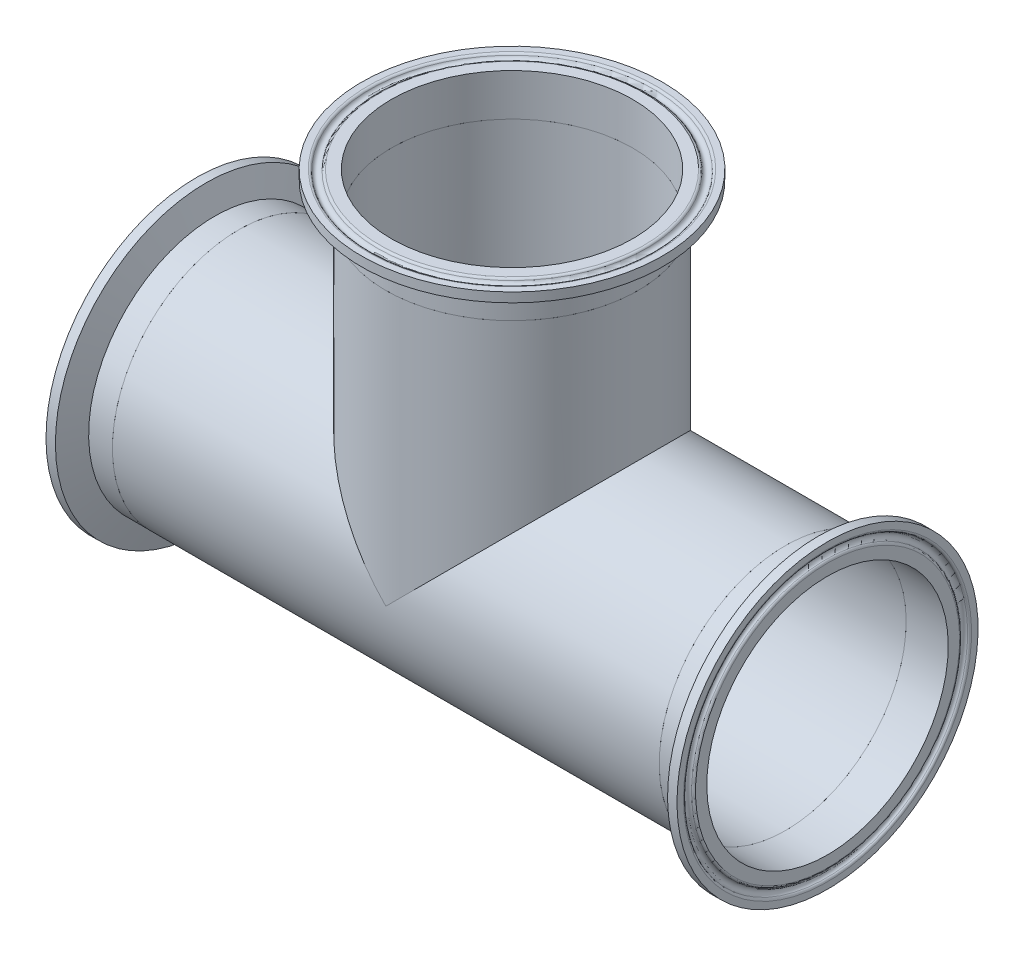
ISO-10303-21;
HEADER;
FILE_DESCRIPTION(('STEP AP214'),'2;1');
FILE_NAME('part.step','',(''),(''),'','','');
FILE_SCHEMA(('AUTOMOTIVE_DESIGN { 1 0 10303 214 1 1 1 1 }'));
ENDSEC;
DATA;
#1=APPLICATION_CONTEXT('core data for automotive mechanical design processes');
#2=APPLICATION_PROTOCOL_DEFINITION('international standard','automotive_design',2000,#1);
#3=PRODUCT_CONTEXT('',#1,'mechanical');
#4=PRODUCT('Part','Part','',(#3));
#5=PRODUCT_RELATED_PRODUCT_CATEGORY('part','',(#4));
#6=PRODUCT_DEFINITION_FORMATION('','',#4);
#7=PRODUCT_DEFINITION_CONTEXT('part definition',#1,'design');
#8=PRODUCT_DEFINITION('design','',#6,#7);
#9=PRODUCT_DEFINITION_SHAPE('','',#8);
#10=(LENGTH_UNIT() NAMED_UNIT(*) SI_UNIT(.MILLI.,.METRE.));
#11=(NAMED_UNIT(*) PLANE_ANGLE_UNIT() SI_UNIT($,.RADIAN.));
#12=(NAMED_UNIT(*) SI_UNIT($,.STERADIAN.) SOLID_ANGLE_UNIT());
#13=UNCERTAINTY_MEASURE_WITH_UNIT(LENGTH_MEASURE(1.E-05),#10,'distance_accuracy_value','');
#14=(GEOMETRIC_REPRESENTATION_CONTEXT(3) GLOBAL_UNCERTAINTY_ASSIGNED_CONTEXT((#13)) GLOBAL_UNIT_ASSIGNED_CONTEXT((#10,
#11,#12)) REPRESENTATION_CONTEXT('',''));
#15=CARTESIAN_POINT('',(0.,0.,0.));
#16=DIRECTION('',(0.,0.,1.));
#17=DIRECTION('',(1.,0.,0.));
#18=AXIS2_PLACEMENT_3D('',#15,#16,#17);
#19=CARTESIAN_POINT('',(170.205074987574,74.7151301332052,127.054306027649));
#20=DIRECTION('',(1.00000000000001,0.,0.));
#21=DIRECTION('',(0.,-0.815972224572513,0.578091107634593));
#22=AXIS2_PLACEMENT_3D('',#19,#20,#21);
#23=TOROIDAL_SURFACE('',#22,43.4867084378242,0.787400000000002);
#24=CARTESIAN_POINT('',(170.992474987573,74.7151301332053,127.054306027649));
#25=DIRECTION('',(1.00000000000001,0.,0.));
#26=DIRECTION('',(0.,-0.815972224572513,0.578091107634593));
#27=AXIS2_PLACEMENT_3D('',#24,#25,#26);
#28=CIRCLE('',#27,43.4867084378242);
#29=CARTESIAN_POINT('',(170.992474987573,39.2311839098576,152.193585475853));
#30=VERTEX_POINT('',#29);
#31=EDGE_CURVE('P0_E48',#30,#30,#28,.T.);
#32=ORIENTED_EDGE('',*,*,#31,.T.);
#33=EDGE_LOOP('',(#32));
#34=FACE_BOUND('',#33,.T.);
#35=CARTESIAN_POINT('',(170.518016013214,74.715130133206,127.054306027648));
#36=DIRECTION('',(1.00000000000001,0.,0.));
#37=DIRECTION('',(0.,-0.815972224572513,0.578091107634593));
#38=AXIS2_PLACEMENT_3D('',#35,#36,#37);
#39=CIRCLE('',#38,42.7641666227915);
#40=CARTESIAN_POINT('',(170.518016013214,39.8207579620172,151.775890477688));
#41=VERTEX_POINT('',#40);
#42=EDGE_CURVE('P0_E9',#41,#41,#39,.T.);
#43=ORIENTED_EDGE('',*,*,#42,.F.);
#44=EDGE_LOOP('',(#43));
#45=FACE_BOUND('',#44,.T.);
#46=ADVANCED_FACE('P0_F14',(#34,#45),#23,.T.);
#47=CARTESIAN_POINT('',(170.992474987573,74.7151301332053,127.054306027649));
#48=DIRECTION('',(1.00000000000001,0.,0.));
#49=DIRECTION('',(0.,-0.815972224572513,0.578091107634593));
#50=AXIS2_PLACEMENT_3D('',#47,#48,#49);
#51=TOROIDAL_SURFACE('',#50,41.6687,1.1938);
#52=CARTESIAN_POINT('',(170.518016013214,74.715130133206,127.054306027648));
#53=DIRECTION('',(1.00000000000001,0.,0.));
#54=DIRECTION('',(0.,-0.815972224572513,0.578091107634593));
#55=AXIS2_PLACEMENT_3D('',#52,#53,#54);
#56=CIRCLE('',#55,40.5732333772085);
#57=CARTESIAN_POINT('',(170.518016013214,41.6084986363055,150.509331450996));
#58=VERTEX_POINT('',#57);
#59=EDGE_CURVE('P0_E20',#58,#58,#56,.T.);
#60=ORIENTED_EDGE('',*,*,#59,.F.);
#61=EDGE_LOOP('',(#60));
#62=FACE_BOUND('',#61,.T.);
#63=ORIENTED_EDGE('',*,*,#42,.T.);
#64=EDGE_LOOP('',(#63));
#65=FACE_BOUND('',#64,.T.);
#66=ADVANCED_FACE('P0_F97',(#62,#65),#51,.F.);
#67=CARTESIAN_POINT('',(170.205074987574,74.7151301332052,127.054306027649));
#68=DIRECTION('',(1.00000000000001,0.,0.));
#69=DIRECTION('',(0.,-0.815972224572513,0.578091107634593));
#70=AXIS2_PLACEMENT_3D('',#67,#68,#69);
#71=TOROIDAL_SURFACE('',#70,39.8506915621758,0.787399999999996);
#72=ORIENTED_EDGE('',*,*,#59,.T.);
#73=EDGE_LOOP('',(#72));
#74=FACE_BOUND('',#73,.T.);
#75=CARTESIAN_POINT('',(170.992474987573,74.7151301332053,127.054306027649));
#76=DIRECTION('',(1.00000000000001,0.,0.));
#77=DIRECTION('',(0.,-0.815972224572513,0.578091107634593));
#78=AXIS2_PLACEMENT_3D('',#75,#76,#77);
#79=CIRCLE('',#78,39.8506915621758);
#80=CARTESIAN_POINT('',(170.992474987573,42.1980726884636,150.091636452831));
#81=VERTEX_POINT('',#80);
#82=EDGE_CURVE('P0_E24',#81,#81,#79,.T.);
#83=ORIENTED_EDGE('',*,*,#82,.F.);
#84=EDGE_LOOP('',(#83));
#85=FACE_BOUND('',#84,.T.);
#86=ADVANCED_FACE('P0_F93',(#74,#85),#71,.T.);
#87=CARTESIAN_POINT('',(170.992474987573,74.7151301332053,127.054306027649));
#88=DIRECTION('',(-1.00000000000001,0.,0.));
#89=DIRECTION('',(0.,0.815972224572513,-0.578091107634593));
#90=AXIS2_PLACEMENT_3D('',#87,#88,#89);
#91=PLANE('',#90);
#92=CARTESIAN_POINT('',(170.992474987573,74.7151301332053,127.054306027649));
#93=DIRECTION('',(1.00000000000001,0.,0.));
#94=DIRECTION('',(0.,-0.815972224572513,0.578091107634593));
#95=AXIS2_PLACEMENT_3D('',#92,#93,#94);
#96=CIRCLE('',#95,36.449);
#97=CARTESIAN_POINT('',(170.992474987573,44.9737585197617,148.125148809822));
#98=VERTEX_POINT('',#97);
#99=EDGE_CURVE('P0_E28',#98,#98,#96,.T.);
#100=ORIENTED_EDGE('',*,*,#99,.F.);
#101=EDGE_LOOP('',(#100));
#102=FACE_BOUND('',#101,.T.);
#103=ORIENTED_EDGE('',*,*,#82,.T.);
#104=EDGE_LOOP('',(#103));
#105=FACE_BOUND('',#104,.T.);
#106=ADVANCED_FACE('P0_F86',(#102,#105),#91,.F.);
#107=CARTESIAN_POINT('',(170.992474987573,74.7151301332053,127.054306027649));
#108=DIRECTION('',(1.00000000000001,0.,0.));
#109=DIRECTION('',(0.,-0.815972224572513,0.578091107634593));
#110=AXIS2_PLACEMENT_3D('',#107,#108,#109);
#111=CYLINDRICAL_SURFACE('',#110,36.449);
#112=ORIENTED_EDGE('',*,*,#99,.T.);
#113=EDGE_LOOP('',(#112));
#114=FACE_BOUND('',#113,.T.);
#115=CARTESIAN_POINT('',(158.292474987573,74.7151301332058,127.05430602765));
#116=DIRECTION('',(1.00000000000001,0.,0.));
#117=DIRECTION('',(0.,-0.815972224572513,0.578091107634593));
#118=AXIS2_PLACEMENT_3D('',#115,#116,#117);
#119=CIRCLE('',#118,36.449);
#120=CARTESIAN_POINT('',(158.292474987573,44.9737585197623,148.125148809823));
#121=VERTEX_POINT('',#120);
#122=EDGE_CURVE('P0_E33',#121,#121,#119,.T.);
#123=ORIENTED_EDGE('',*,*,#122,.F.);
#124=EDGE_LOOP('',(#123));
#125=FACE_BOUND('',#124,.T.);
#126=ADVANCED_FACE('P0_F81',(#114,#125),#111,.F.);
#127=CARTESIAN_POINT('',(158.292474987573,74.7151301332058,127.05430602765));
#128=DIRECTION('',(1.00000000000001,0.,0.));
#129=DIRECTION('',(0.,-0.815972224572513,0.578091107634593));
#130=AXIS2_PLACEMENT_3D('',#127,#128,#129);
#131=PLANE('',#130);
#132=CARTESIAN_POINT('',(158.292474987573,74.7151301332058,127.05430602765));
#133=DIRECTION('',(1.00000000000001,0.,0.));
#134=DIRECTION('',(0.,-0.815972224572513,0.578091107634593));
#135=AXIS2_PLACEMENT_3D('',#132,#133,#134);
#136=CIRCLE('',#135,38.1);
#137=CARTESIAN_POINT('',(158.292474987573,43.626588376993,149.079577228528));
#138=VERTEX_POINT('',#137);
#139=EDGE_CURVE('P0_E36',#138,#138,#136,.T.);
#140=ORIENTED_EDGE('',*,*,#139,.F.);
#141=EDGE_LOOP('',(#140));
#142=FACE_BOUND('',#141,.T.);
#143=ORIENTED_EDGE('',*,*,#122,.T.);
#144=EDGE_LOOP('',(#143));
#145=FACE_BOUND('',#144,.T.);
#146=ADVANCED_FACE('P0_F75',(#142,#145),#131,.F.);
#147=CARTESIAN_POINT('',(170.992474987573,74.7151301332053,127.054306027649));
#148=DIRECTION('',(1.00000000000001,0.,0.));
#149=DIRECTION('',(0.,-0.815972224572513,0.578091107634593));
#150=AXIS2_PLACEMENT_3D('',#147,#148,#149);
#151=CYLINDRICAL_SURFACE('',#150,38.1);
#152=CARTESIAN_POINT('',(165.471292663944,74.7151301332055,127.054306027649));
#153=DIRECTION('',(1.00000000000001,0.,0.));
#154=DIRECTION('',(0.,-0.815972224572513,0.578091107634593));
#155=AXIS2_PLACEMENT_3D('',#152,#153,#154);
#156=CIRCLE('',#155,38.1);
#157=CARTESIAN_POINT('',(165.471292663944,43.6265883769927,149.079577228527));
#158=VERTEX_POINT('',#157);
#159=EDGE_CURVE('P0_E39',#158,#158,#156,.T.);
#160=ORIENTED_EDGE('',*,*,#159,.F.);
#161=EDGE_LOOP('',(#160));
#162=FACE_BOUND('',#161,.T.);
#163=ORIENTED_EDGE('',*,*,#139,.T.);
#164=EDGE_LOOP('',(#163));
#165=FACE_BOUND('',#164,.T.);
#166=ADVANCED_FACE('P0_F69',(#162,#165),#151,.T.);
#167=CARTESIAN_POINT('',(165.471292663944,74.7151301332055,127.054306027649));
#168=DIRECTION('',(1.00000000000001,0.,0.));
#169=DIRECTION('',(0.,-0.815972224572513,0.578091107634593));
#170=AXIS2_PLACEMENT_3D('',#167,#168,#169);
#171=CONICAL_SURFACE('',#170,38.1,1.22173047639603);
#172=CARTESIAN_POINT('',(168.147674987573,74.7151301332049,127.054306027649));
#173=DIRECTION('',(1.00000000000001,0.,0.));
#174=DIRECTION('',(0.,-0.815972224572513,0.578091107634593));
#175=AXIS2_PLACEMENT_3D('',#172,#173,#174);
#176=CIRCLE('',#175,45.4533);
#177=CARTESIAN_POINT('',(168.147674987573,37.6264998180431,153.330454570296));
#178=VERTEX_POINT('',#177);
#179=EDGE_CURVE('P0_E42',#178,#178,#176,.T.);
#180=ORIENTED_EDGE('',*,*,#179,.F.);
#181=EDGE_LOOP('',(#180));
#182=FACE_BOUND('',#181,.T.);
#183=ORIENTED_EDGE('',*,*,#159,.T.);
#184=EDGE_LOOP('',(#183));
#185=FACE_BOUND('',#184,.T.);
#186=ADVANCED_FACE('P0_F63',(#182,#185),#171,.T.);
#187=CARTESIAN_POINT('',(170.992474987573,74.7151301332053,127.054306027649));
#188=DIRECTION('',(1.00000000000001,0.,0.));
#189=DIRECTION('',(0.,-0.815972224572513,0.578091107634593));
#190=AXIS2_PLACEMENT_3D('',#187,#188,#189);
#191=CYLINDRICAL_SURFACE('',#190,45.4533);
#192=CARTESIAN_POINT('',(170.992474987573,74.7151301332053,127.054306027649));
#193=DIRECTION('',(1.00000000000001,0.,0.));
#194=DIRECTION('',(0.,-0.815972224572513,0.578091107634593));
#195=AXIS2_PLACEMENT_3D('',#192,#193,#194);
#196=CIRCLE('',#195,45.4533);
#197=CARTESIAN_POINT('',(170.992474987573,37.6264998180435,153.330454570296));
#198=VERTEX_POINT('',#197);
#199=EDGE_CURVE('P0_E45',#198,#198,#196,.T.);
#200=ORIENTED_EDGE('',*,*,#199,.F.);
#201=EDGE_LOOP('',(#200));
#202=FACE_BOUND('',#201,.T.);
#203=ORIENTED_EDGE('',*,*,#179,.T.);
#204=EDGE_LOOP('',(#203));
#205=FACE_BOUND('',#204,.T.);
#206=ADVANCED_FACE('P0_F57',(#202,#205),#191,.T.);
#207=CARTESIAN_POINT('',(170.992474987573,74.7151301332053,127.054306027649));
#208=DIRECTION('',(-1.00000000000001,0.,0.));
#209=DIRECTION('',(0.,0.815972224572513,-0.578091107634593));
#210=AXIS2_PLACEMENT_3D('',#207,#208,#209);
#211=PLANE('',#210);
#212=ORIENTED_EDGE('',*,*,#31,.F.);
#213=EDGE_LOOP('',(#212));
#214=FACE_BOUND('',#213,.T.);
#215=ORIENTED_EDGE('',*,*,#199,.T.);
#216=EDGE_LOOP('',(#215));
#217=FACE_BOUND('',#216,.T.);
#218=ADVANCED_FACE('P0_F54',(#214,#217),#211,.F.);
#219=CLOSED_SHELL('',(#46,#66,#86,#106,#126,#146,#166,#186,#206,#218));
#220=MANIFOLD_SOLID_BREP('P0_B1',#219);
#221=CARTESIAN_POINT('',(75.7424749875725,169.177730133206,127.05430602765));
#222=DIRECTION('',(0.,1.00000000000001,0.));
#223=DIRECTION('',(-0.679087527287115,0.,-0.734057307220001));
#224=AXIS2_PLACEMENT_3D('',#221,#222,#223);
#225=TOROIDAL_SURFACE('',#224,43.4867084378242,0.787400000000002);
#226=CARTESIAN_POINT('',(75.7424749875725,169.965130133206,127.05430602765));
#227=DIRECTION('',(0.,1.00000000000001,0.));
#228=DIRECTION('',(-0.679087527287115,0.,-0.734057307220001));
#229=AXIS2_PLACEMENT_3D('',#226,#227,#228);
#230=CIRCLE('',#229,43.4867084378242);
#231=CARTESIAN_POINT('',(46.2111936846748,169.965130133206,95.1325699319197));
#232=VERTEX_POINT('',#231);
#233=EDGE_CURVE('P1_E49',#232,#232,#230,.T.);
#234=ORIENTED_EDGE('',*,*,#233,.T.);
#235=EDGE_LOOP('',(#234));
#236=FACE_BOUND('',#235,.T.);
#237=CARTESIAN_POINT('',(75.7424749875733,169.490671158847,127.054306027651));
#238=DIRECTION('',(0.,1.00000000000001,0.));
#239=DIRECTION('',(-0.679087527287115,0.,-0.734057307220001));
#240=AXIS2_PLACEMENT_3D('',#237,#238,#239);
#241=CIRCLE('',#240,42.7641666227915);
#242=CARTESIAN_POINT('',(46.7018628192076,169.490671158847,95.6629570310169));
#243=VERTEX_POINT('',#242);
#244=EDGE_CURVE('P1_E10',#243,#243,#241,.T.);
#245=ORIENTED_EDGE('',*,*,#244,.F.);
#246=EDGE_LOOP('',(#245));
#247=FACE_BOUND('',#246,.T.);
#248=ADVANCED_FACE('P1_F15',(#236,#247),#225,.T.);
#249=CARTESIAN_POINT('',(75.7424749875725,169.965130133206,127.05430602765));
#250=DIRECTION('',(0.,1.00000000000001,0.));
#251=DIRECTION('',(-0.679087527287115,0.,-0.734057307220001));
#252=AXIS2_PLACEMENT_3D('',#249,#250,#251);
#253=TOROIDAL_SURFACE('',#252,41.6687,1.1938);
#254=CARTESIAN_POINT('',(75.7424749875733,169.490671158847,127.054306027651));
#255=DIRECTION('',(0.,1.00000000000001,0.));
#256=DIRECTION('',(-0.679087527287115,0.,-0.734057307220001));
#257=AXIS2_PLACEMENT_3D('',#254,#255,#256);
#258=CIRCLE('',#257,40.5732333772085);
#259=CARTESIAN_POINT('',(48.1896982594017,169.490671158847,97.2712275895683));
#260=VERTEX_POINT('',#259);
#261=EDGE_CURVE('P1_E21',#260,#260,#258,.T.);
#262=ORIENTED_EDGE('',*,*,#261,.F.);
#263=EDGE_LOOP('',(#262));
#264=FACE_BOUND('',#263,.T.);
#265=ORIENTED_EDGE('',*,*,#244,.T.);
#266=EDGE_LOOP('',(#265));
#267=FACE_BOUND('',#266,.T.);
#268=ADVANCED_FACE('P1_F98',(#264,#267),#253,.F.);
#269=CARTESIAN_POINT('',(75.7424749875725,169.177730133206,127.05430602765));
#270=DIRECTION('',(0.,1.00000000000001,0.));
#271=DIRECTION('',(-0.679087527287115,0.,-0.734057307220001));
#272=AXIS2_PLACEMENT_3D('',#269,#270,#271);
#273=TOROIDAL_SURFACE('',#272,39.8506915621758,0.787399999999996);
#274=ORIENTED_EDGE('',*,*,#261,.T.);
#275=EDGE_LOOP('',(#274));
#276=FACE_BOUND('',#275,.T.);
#277=CARTESIAN_POINT('',(75.7424749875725,169.965130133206,127.05430602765));
#278=DIRECTION('',(0.,1.00000000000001,0.));
#279=DIRECTION('',(-0.679087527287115,0.,-0.734057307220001));
#280=AXIS2_PLACEMENT_3D('',#277,#278,#279);
#281=CIRCLE('',#280,39.8506915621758);
#282=CARTESIAN_POINT('',(48.6803673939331,169.965130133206,97.8016146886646));
#283=VERTEX_POINT('',#282);
#284=EDGE_CURVE('P1_E25',#283,#283,#281,.T.);
#285=ORIENTED_EDGE('',*,*,#284,.F.);
#286=EDGE_LOOP('',(#285));
#287=FACE_BOUND('',#286,.T.);
#288=ADVANCED_FACE('P1_F94',(#276,#287),#273,.T.);
#289=CARTESIAN_POINT('',(75.7424749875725,169.965130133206,127.05430602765));
#290=DIRECTION('',(0.,-1.00000000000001,0.));
#291=DIRECTION('',(0.679087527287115,0.,0.734057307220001));
#292=AXIS2_PLACEMENT_3D('',#289,#290,#291);
#293=PLANE('',#292);
#294=CARTESIAN_POINT('',(75.7424749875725,169.965130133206,127.05430602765));
#295=DIRECTION('',(0.,1.00000000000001,0.));
#296=DIRECTION('',(-0.679087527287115,0.,-0.734057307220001));
#297=AXIS2_PLACEMENT_3D('',#294,#295,#296);
#298=CIRCLE('',#297,36.449);
#299=CARTESIAN_POINT('',(50.9904137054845,169.965130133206,100.298651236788));
#300=VERTEX_POINT('',#299);
#301=EDGE_CURVE('P1_E29',#300,#300,#298,.T.);
#302=ORIENTED_EDGE('',*,*,#301,.F.);
#303=EDGE_LOOP('',(#302));
#304=FACE_BOUND('',#303,.T.);
#305=ORIENTED_EDGE('',*,*,#284,.T.);
#306=EDGE_LOOP('',(#305));
#307=FACE_BOUND('',#306,.T.);
#308=ADVANCED_FACE('P1_F87',(#304,#307),#293,.F.);
#309=CARTESIAN_POINT('',(75.7424749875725,169.965130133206,127.05430602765));
#310=DIRECTION('',(0.,1.00000000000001,0.));
#311=DIRECTION('',(-0.679087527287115,0.,-0.734057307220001));
#312=AXIS2_PLACEMENT_3D('',#309,#310,#311);
#313=CYLINDRICAL_SURFACE('',#312,36.449);
#314=ORIENTED_EDGE('',*,*,#301,.T.);
#315=EDGE_LOOP('',(#314));
#316=FACE_BOUND('',#315,.T.);
#317=CARTESIAN_POINT('',(75.7424749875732,157.265130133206,127.05430602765));
#318=DIRECTION('',(0.,1.00000000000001,0.));
#319=DIRECTION('',(-0.679087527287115,0.,-0.734057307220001));
#320=AXIS2_PLACEMENT_3D('',#317,#318,#319);
#321=CIRCLE('',#320,36.449);
#322=CARTESIAN_POINT('',(50.9904137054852,157.265130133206,100.298651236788));
#323=VERTEX_POINT('',#322);
#324=EDGE_CURVE('P1_E34',#323,#323,#321,.T.);
#325=ORIENTED_EDGE('',*,*,#324,.F.);
#326=EDGE_LOOP('',(#325));
#327=FACE_BOUND('',#326,.T.);
#328=ADVANCED_FACE('P1_F82',(#316,#327),#313,.F.);
#329=CARTESIAN_POINT('',(75.7424749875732,157.265130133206,127.05430602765));
#330=DIRECTION('',(0.,1.00000000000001,0.));
#331=DIRECTION('',(-0.679087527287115,0.,-0.734057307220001));
#332=AXIS2_PLACEMENT_3D('',#329,#330,#331);
#333=PLANE('',#332);
#334=CARTESIAN_POINT('',(75.7424749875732,157.265130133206,127.05430602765));
#335=DIRECTION('',(0.,1.00000000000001,0.));
#336=DIRECTION('',(-0.679087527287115,0.,-0.734057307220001));
#337=AXIS2_PLACEMENT_3D('',#334,#335,#336);
#338=CIRCLE('',#337,38.1);
#339=CARTESIAN_POINT('',(49.8692401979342,157.265130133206,99.0867226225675));
#340=VERTEX_POINT('',#339);
#341=EDGE_CURVE('P1_E37',#340,#340,#338,.T.);
#342=ORIENTED_EDGE('',*,*,#341,.F.);
#343=EDGE_LOOP('',(#342));
#344=FACE_BOUND('',#343,.T.);
#345=ORIENTED_EDGE('',*,*,#324,.T.);
#346=EDGE_LOOP('',(#345));
#347=FACE_BOUND('',#346,.T.);
#348=ADVANCED_FACE('P1_F76',(#344,#347),#333,.F.);
#349=CARTESIAN_POINT('',(75.7424749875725,169.965130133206,127.05430602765));
#350=DIRECTION('',(0.,1.00000000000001,0.));
#351=DIRECTION('',(-0.679087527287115,0.,-0.734057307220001));
#352=AXIS2_PLACEMENT_3D('',#349,#350,#351);
#353=CYLINDRICAL_SURFACE('',#352,38.1);
#354=CARTESIAN_POINT('',(75.7424749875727,164.443947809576,127.05430602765));
#355=DIRECTION('',(0.,1.00000000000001,0.));
#356=DIRECTION('',(-0.679087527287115,0.,-0.734057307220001));
#357=AXIS2_PLACEMENT_3D('',#354,#355,#356);
#358=CIRCLE('',#357,38.1);
#359=CARTESIAN_POINT('',(49.8692401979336,164.443947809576,99.0867226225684));
#360=VERTEX_POINT('',#359);
#361=EDGE_CURVE('P1_E40',#360,#360,#358,.T.);
#362=ORIENTED_EDGE('',*,*,#361,.F.);
#363=EDGE_LOOP('',(#362));
#364=FACE_BOUND('',#363,.T.);
#365=ORIENTED_EDGE('',*,*,#341,.T.);
#366=EDGE_LOOP('',(#365));
#367=FACE_BOUND('',#366,.T.);
#368=ADVANCED_FACE('P1_F70',(#364,#367),#353,.T.);
#369=CARTESIAN_POINT('',(75.7424749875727,164.443947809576,127.05430602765));
#370=DIRECTION('',(0.,1.00000000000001,0.));
#371=DIRECTION('',(-0.679087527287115,0.,-0.734057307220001));
#372=AXIS2_PLACEMENT_3D('',#369,#370,#371);
#373=CONICAL_SURFACE('',#372,38.1,1.22173047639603);
#374=CARTESIAN_POINT('',(75.7424749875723,167.120330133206,127.05430602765));
#375=DIRECTION('',(0.,1.00000000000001,0.));
#376=DIRECTION('',(-0.679087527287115,0.,-0.734057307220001));
#377=AXIS2_PLACEMENT_3D('',#374,#375,#376);
#378=CIRCLE('',#377,45.4533);
#379=CARTESIAN_POINT('',(44.8757058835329,167.120330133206,93.6889790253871));
#380=VERTEX_POINT('',#379);
#381=EDGE_CURVE('P1_E43',#380,#380,#378,.T.);
#382=ORIENTED_EDGE('',*,*,#381,.F.);
#383=EDGE_LOOP('',(#382));
#384=FACE_BOUND('',#383,.T.);
#385=ORIENTED_EDGE('',*,*,#361,.T.);
#386=EDGE_LOOP('',(#385));
#387=FACE_BOUND('',#386,.T.);
#388=ADVANCED_FACE('P1_F64',(#384,#387),#373,.T.);
#389=CARTESIAN_POINT('',(75.7424749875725,169.965130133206,127.05430602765));
#390=DIRECTION('',(0.,1.00000000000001,0.));
#391=DIRECTION('',(-0.679087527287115,0.,-0.734057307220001));
#392=AXIS2_PLACEMENT_3D('',#389,#390,#391);
#393=CYLINDRICAL_SURFACE('',#392,45.4533);
#394=CARTESIAN_POINT('',(75.7424749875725,169.965130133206,127.05430602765));
#395=DIRECTION('',(0.,1.00000000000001,0.));
#396=DIRECTION('',(-0.679087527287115,0.,-0.734057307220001));
#397=AXIS2_PLACEMENT_3D('',#394,#395,#396);
#398=CIRCLE('',#397,45.4533);
#399=CARTESIAN_POINT('',(44.8757058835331,169.965130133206,93.6889790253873));
#400=VERTEX_POINT('',#399);
#401=EDGE_CURVE('P1_E46',#400,#400,#398,.T.);
#402=ORIENTED_EDGE('',*,*,#401,.F.);
#403=EDGE_LOOP('',(#402));
#404=FACE_BOUND('',#403,.T.);
#405=ORIENTED_EDGE('',*,*,#381,.T.);
#406=EDGE_LOOP('',(#405));
#407=FACE_BOUND('',#406,.T.);
#408=ADVANCED_FACE('P1_F58',(#404,#407),#393,.T.);
#409=CARTESIAN_POINT('',(75.7424749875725,169.965130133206,127.05430602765));
#410=DIRECTION('',(0.,-1.00000000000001,0.));
#411=DIRECTION('',(0.679087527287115,0.,0.734057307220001));
#412=AXIS2_PLACEMENT_3D('',#409,#410,#411);
#413=PLANE('',#412);
#414=ORIENTED_EDGE('',*,*,#233,.F.);
#415=EDGE_LOOP('',(#414));
#416=FACE_BOUND('',#415,.T.);
#417=ORIENTED_EDGE('',*,*,#401,.T.);
#418=EDGE_LOOP('',(#417));
#419=FACE_BOUND('',#418,.T.);
#420=ADVANCED_FACE('P1_F55',(#416,#419),#413,.F.);
#421=CLOSED_SHELL('',(#248,#268,#288,#308,#328,#348,#368,#388,#408,#420));
#422=MANIFOLD_SOLID_BREP('P1_B1',#421);
#423=CARTESIAN_POINT('',(-18.7201250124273,74.715130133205,127.054306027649));
#424=DIRECTION('',(-1.00000000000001,0.,0.));
#425=DIRECTION('',(0.,0.785082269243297,-0.619391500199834));
#426=AXIS2_PLACEMENT_3D('',#423,#424,#425);
#427=TOROIDAL_SURFACE('',#426,43.4867084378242,0.787400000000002);
#428=CARTESIAN_POINT('',(-19.5075250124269,74.7151301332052,127.054306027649));
#429=DIRECTION('',(-1.00000000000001,0.,0.));
#430=DIRECTION('',(0.,0.785082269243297,-0.619391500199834));
#431=AXIS2_PLACEMENT_3D('',#428,#429,#430);
#432=CIRCLE('',#431,43.4867084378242);
#433=CARTESIAN_POINT('',(-19.5075250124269,108.855773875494,100.119008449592));
#434=VERTEX_POINT('',#433);
#435=EDGE_CURVE('P2_E49',#434,#434,#432,.T.);
#436=ORIENTED_EDGE('',*,*,#435,.T.);
#437=EDGE_LOOP('',(#436));
#438=FACE_BOUND('',#437,.T.);
#439=CARTESIAN_POINT('',(-19.0330660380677,74.7151301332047,127.054306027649));
#440=DIRECTION('',(-1.00000000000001,0.,0.));
#441=DIRECTION('',(0.,0.785082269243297,-0.619391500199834));
#442=AXIS2_PLACEMENT_3D('',#439,#440,#441);
#443=CIRCLE('',#442,42.7641666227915);
#444=CARTESIAN_POINT('',(-19.0330660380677,108.288519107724,100.566544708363));
#445=VERTEX_POINT('',#444);
#446=EDGE_CURVE('P2_E10',#445,#445,#443,.T.);
#447=ORIENTED_EDGE('',*,*,#446,.F.);
#448=EDGE_LOOP('',(#447));
#449=FACE_BOUND('',#448,.T.);
#450=ADVANCED_FACE('P2_F15',(#438,#449),#427,.T.);
#451=CARTESIAN_POINT('',(-19.5075250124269,74.7151301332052,127.054306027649));
#452=DIRECTION('',(-1.00000000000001,0.,0.));
#453=DIRECTION('',(0.,0.785082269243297,-0.619391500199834));
#454=AXIS2_PLACEMENT_3D('',#451,#452,#453);
#455=TOROIDAL_SURFACE('',#454,41.6687,1.1938);
#456=CARTESIAN_POINT('',(-19.0330660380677,74.7151301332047,127.054306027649));
#457=DIRECTION('',(-1.00000000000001,0.,0.));
#458=DIRECTION('',(0.,0.785082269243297,-0.619391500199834));
#459=AXIS2_PLACEMENT_3D('',#456,#457,#458);
#460=CIRCLE('',#459,40.5732333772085);
#461=CARTESIAN_POINT('',(-19.0330660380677,106.568456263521,101.923590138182));
#462=VERTEX_POINT('',#461);
#463=EDGE_CURVE('P2_E21',#462,#462,#460,.T.);
#464=ORIENTED_EDGE('',*,*,#463,.F.);
#465=EDGE_LOOP('',(#464));
#466=FACE_BOUND('',#465,.T.);
#467=ORIENTED_EDGE('',*,*,#446,.T.);
#468=EDGE_LOOP('',(#467));
#469=FACE_BOUND('',#468,.T.);
#470=ADVANCED_FACE('P2_F98',(#466,#469),#455,.F.);
#471=CARTESIAN_POINT('',(-18.7201250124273,74.715130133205,127.054306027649));
#472=DIRECTION('',(-1.00000000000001,0.,0.));
#473=DIRECTION('',(0.,0.785082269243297,-0.619391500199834));
#474=AXIS2_PLACEMENT_3D('',#471,#472,#473);
#475=TOROIDAL_SURFACE('',#474,39.8506915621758,0.787399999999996);
#476=ORIENTED_EDGE('',*,*,#463,.T.);
#477=EDGE_LOOP('',(#476));
#478=FACE_BOUND('',#477,.T.);
#479=CARTESIAN_POINT('',(-19.5075250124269,74.7151301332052,127.054306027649));
#480=DIRECTION('',(-1.00000000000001,0.,0.));
#481=DIRECTION('',(0.,0.785082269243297,-0.619391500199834));
#482=AXIS2_PLACEMENT_3D('',#479,#480,#481);
#483=CIRCLE('',#482,39.8506915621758);
#484=CARTESIAN_POINT('',(-19.5075250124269,106.001201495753,102.371126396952));
#485=VERTEX_POINT('',#484);
#486=EDGE_CURVE('P2_E25',#485,#485,#483,.T.);
#487=ORIENTED_EDGE('',*,*,#486,.F.);
#488=EDGE_LOOP('',(#487));
#489=FACE_BOUND('',#488,.T.);
#490=ADVANCED_FACE('P2_F94',(#478,#489),#475,.T.);
#491=CARTESIAN_POINT('',(-19.5075250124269,74.7151301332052,127.054306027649));
#492=DIRECTION('',(1.00000000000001,0.,0.));
#493=DIRECTION('',(0.,-0.785082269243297,0.619391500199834));
#494=AXIS2_PLACEMENT_3D('',#491,#492,#493);
#495=PLANE('',#494);
#496=CARTESIAN_POINT('',(-19.5075250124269,74.7151301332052,127.054306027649));
#497=DIRECTION('',(-1.00000000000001,0.,0.));
#498=DIRECTION('',(0.,0.785082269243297,-0.619391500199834));
#499=AXIS2_PLACEMENT_3D('',#496,#497,#498);
#500=CIRCLE('',#499,36.449);
#501=CARTESIAN_POINT('',(-19.5075250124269,103.330593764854,104.478105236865));
#502=VERTEX_POINT('',#501);
#503=EDGE_CURVE('P2_E29',#502,#502,#500,.T.);
#504=ORIENTED_EDGE('',*,*,#503,.F.);
#505=EDGE_LOOP('',(#504));
#506=FACE_BOUND('',#505,.T.);
#507=ORIENTED_EDGE('',*,*,#486,.T.);
#508=EDGE_LOOP('',(#507));
#509=FACE_BOUND('',#508,.T.);
#510=ADVANCED_FACE('P2_F87',(#506,#509),#495,.F.);
#511=CARTESIAN_POINT('',(-19.5075250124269,74.7151301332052,127.054306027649));
#512=DIRECTION('',(-1.00000000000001,0.,0.));
#513=DIRECTION('',(0.,0.785082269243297,-0.619391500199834));
#514=AXIS2_PLACEMENT_3D('',#511,#512,#513);
#515=CYLINDRICAL_SURFACE('',#514,36.449);
#516=ORIENTED_EDGE('',*,*,#503,.T.);
#517=EDGE_LOOP('',(#516));
#518=FACE_BOUND('',#517,.T.);
#519=CARTESIAN_POINT('',(-6.80752501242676,74.7151301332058,127.05430602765));
#520=DIRECTION('',(-1.00000000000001,0.,0.));
#521=DIRECTION('',(0.,0.785082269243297,-0.619391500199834));
#522=AXIS2_PLACEMENT_3D('',#519,#520,#521);
#523=CIRCLE('',#522,36.449);
#524=CARTESIAN_POINT('',(-6.80752501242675,103.330593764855,104.478105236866));
#525=VERTEX_POINT('',#524);
#526=EDGE_CURVE('P2_E34',#525,#525,#523,.T.);
#527=ORIENTED_EDGE('',*,*,#526,.F.);
#528=EDGE_LOOP('',(#527));
#529=FACE_BOUND('',#528,.T.);
#530=ADVANCED_FACE('P2_F82',(#518,#529),#515,.F.);
#531=CARTESIAN_POINT('',(-6.80752501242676,74.7151301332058,127.05430602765));
#532=DIRECTION('',(-1.00000000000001,0.,0.));
#533=DIRECTION('',(0.,0.785082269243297,-0.619391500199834));
#534=AXIS2_PLACEMENT_3D('',#531,#532,#533);
#535=PLANE('',#534);
#536=CARTESIAN_POINT('',(-6.80752501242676,74.7151301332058,127.05430602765));
#537=DIRECTION('',(-1.00000000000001,0.,0.));
#538=DIRECTION('',(0.,0.785082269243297,-0.619391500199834));
#539=AXIS2_PLACEMENT_3D('',#536,#537,#538);
#540=CIRCLE('',#539,38.1);
#541=CARTESIAN_POINT('',(-6.80752501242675,104.626764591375,103.455489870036));
#542=VERTEX_POINT('',#541);
#543=EDGE_CURVE('P2_E37',#542,#542,#540,.T.);
#544=ORIENTED_EDGE('',*,*,#543,.F.);
#545=EDGE_LOOP('',(#544));
#546=FACE_BOUND('',#545,.T.);
#547=ORIENTED_EDGE('',*,*,#526,.T.);
#548=EDGE_LOOP('',(#547));
#549=FACE_BOUND('',#548,.T.);
#550=ADVANCED_FACE('P2_F76',(#546,#549),#535,.F.);
#551=CARTESIAN_POINT('',(-19.5075250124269,74.7151301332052,127.054306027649));
#552=DIRECTION('',(-1.00000000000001,0.,0.));
#553=DIRECTION('',(0.,0.785082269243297,-0.619391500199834));
#554=AXIS2_PLACEMENT_3D('',#551,#552,#553);
#555=CYLINDRICAL_SURFACE('',#554,38.1);
#556=CARTESIAN_POINT('',(-13.9863426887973,74.7151301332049,127.054306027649));
#557=DIRECTION('',(-1.00000000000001,0.,0.));
#558=DIRECTION('',(0.,0.785082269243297,-0.619391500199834));
#559=AXIS2_PLACEMENT_3D('',#556,#557,#558);
#560=CIRCLE('',#559,38.1);
#561=CARTESIAN_POINT('',(-13.9863426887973,104.626764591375,103.455489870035));
#562=VERTEX_POINT('',#561);
#563=EDGE_CURVE('P2_E40',#562,#562,#560,.T.);
#564=ORIENTED_EDGE('',*,*,#563,.F.);
#565=EDGE_LOOP('',(#564));
#566=FACE_BOUND('',#565,.T.);
#567=ORIENTED_EDGE('',*,*,#543,.T.);
#568=EDGE_LOOP('',(#567));
#569=FACE_BOUND('',#568,.T.);
#570=ADVANCED_FACE('P2_F70',(#566,#569),#555,.T.);
#571=CARTESIAN_POINT('',(-13.9863426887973,74.7151301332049,127.054306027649));
#572=DIRECTION('',(-1.00000000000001,0.,0.));
#573=DIRECTION('',(0.,0.785082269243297,-0.619391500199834));
#574=AXIS2_PLACEMENT_3D('',#571,#572,#573);
#575=CONICAL_SURFACE('',#574,38.1,1.22173047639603);
#576=CARTESIAN_POINT('',(-16.6627250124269,74.7151301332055,127.054306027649));
#577=DIRECTION('',(-1.00000000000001,0.,0.));
#578=DIRECTION('',(0.,0.785082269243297,-0.619391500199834));
#579=AXIS2_PLACEMENT_3D('',#576,#577,#578);
#580=CIRCLE('',#579,45.4533);
#581=CARTESIAN_POINT('',(-16.6627250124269,110.399710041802,98.9009183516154));
#582=VERTEX_POINT('',#581);
#583=EDGE_CURVE('P2_E43',#582,#582,#580,.T.);
#584=ORIENTED_EDGE('',*,*,#583,.F.);
#585=EDGE_LOOP('',(#584));
#586=FACE_BOUND('',#585,.T.);
#587=ORIENTED_EDGE('',*,*,#563,.T.);
#588=EDGE_LOOP('',(#587));
#589=FACE_BOUND('',#588,.T.);
#590=ADVANCED_FACE('P2_F64',(#586,#589),#575,.T.);
#591=CARTESIAN_POINT('',(-19.5075250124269,74.7151301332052,127.054306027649));
#592=DIRECTION('',(-1.00000000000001,0.,0.));
#593=DIRECTION('',(0.,0.785082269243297,-0.619391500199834));
#594=AXIS2_PLACEMENT_3D('',#591,#592,#593);
#595=CYLINDRICAL_SURFACE('',#594,45.4533);
#596=CARTESIAN_POINT('',(-19.5075250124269,74.7151301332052,127.054306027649));
#597=DIRECTION('',(-1.00000000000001,0.,0.));
#598=DIRECTION('',(0.,0.785082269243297,-0.619391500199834));
#599=AXIS2_PLACEMENT_3D('',#596,#597,#598);
#600=CIRCLE('',#599,45.4533);
#601=CARTESIAN_POINT('',(-19.5075250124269,110.399710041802,98.9009183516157));
#602=VERTEX_POINT('',#601);
#603=EDGE_CURVE('P2_E46',#602,#602,#600,.T.);
#604=ORIENTED_EDGE('',*,*,#603,.F.);
#605=EDGE_LOOP('',(#604));
#606=FACE_BOUND('',#605,.T.);
#607=ORIENTED_EDGE('',*,*,#583,.T.);
#608=EDGE_LOOP('',(#607));
#609=FACE_BOUND('',#608,.T.);
#610=ADVANCED_FACE('P2_F58',(#606,#609),#595,.T.);
#611=CARTESIAN_POINT('',(-19.5075250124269,74.7151301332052,127.054306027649));
#612=DIRECTION('',(1.00000000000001,0.,0.));
#613=DIRECTION('',(0.,-0.785082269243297,0.619391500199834));
#614=AXIS2_PLACEMENT_3D('',#611,#612,#613);
#615=PLANE('',#614);
#616=ORIENTED_EDGE('',*,*,#435,.F.);
#617=EDGE_LOOP('',(#616));
#618=FACE_BOUND('',#617,.T.);
#619=ORIENTED_EDGE('',*,*,#603,.T.);
#620=EDGE_LOOP('',(#619));
#621=FACE_BOUND('',#620,.T.);
#622=ADVANCED_FACE('P2_F55',(#618,#621),#615,.F.);
#623=CLOSED_SHELL('',(#450,#470,#490,#510,#530,#550,#570,#590,#610,#622));
#624=MANIFOLD_SOLID_BREP('P2_B1',#623);
#625=CARTESIAN_POINT('',(75.7424749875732,157.265130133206,127.05430602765));
#626=DIRECTION('',(0.,-1.,0.));
#627=DIRECTION('',(0.,0.,-1.));
#628=AXIS2_PLACEMENT_3D('',#625,#626,#627);
#629=CYLINDRICAL_SURFACE('',#628,38.1);
#630=CARTESIAN_POINT('',(75.7424749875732,157.265130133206,127.05430602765));
#631=DIRECTION('',(0.,1.,0.));
#632=DIRECTION('',(0.,0.,1.));
#633=AXIS2_PLACEMENT_3D('',#630,#631,#632);
#634=CIRCLE('',#633,38.1);
#635=CARTESIAN_POINT('',(75.7424749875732,157.265130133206,165.15430602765));
#636=VERTEX_POINT('',#635);
#637=EDGE_CURVE('P3_E11',#636,#636,#634,.T.);
#638=ORIENTED_EDGE('',*,*,#637,.F.);
#639=EDGE_LOOP('',(#638));
#640=FACE_BOUND('',#639,.T.);
#641=CARTESIAN_POINT('',(75.7424749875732,74.7151301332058,127.05430602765));
#642=DIRECTION('',(-0.707106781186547,-0.707106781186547,0.));
#643=DIRECTION('',(0.707106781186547,-0.707106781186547,0.));
#644=AXIS2_PLACEMENT_3D('',#641,#642,#643);
#645=ELLIPSE('',#644,53.8815367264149,38.1);
#646=CARTESIAN_POINT('',(75.7424749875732,74.7151301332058,165.15430602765));
#647=VERTEX_POINT('',#646);
#648=CARTESIAN_POINT('',(75.7424749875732,74.7151301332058,88.9543060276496));
#649=VERTEX_POINT('',#648);
#650=EDGE_CURVE('P3_E24',#647,#649,#645,.T.);
#651=ORIENTED_EDGE('',*,*,#650,.F.);
#652=CARTESIAN_POINT('',(75.7424749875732,74.7151301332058,127.05430602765));
#653=DIRECTION('',(0.707106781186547,-0.707106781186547,0.));
#654=DIRECTION('',(-0.707106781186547,-0.707106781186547,0.));
#655=AXIS2_PLACEMENT_3D('',#652,#653,#654);
#656=ELLIPSE('',#655,53.8815367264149,38.1);
#657=EDGE_CURVE('P3_E37',#649,#647,#656,.T.);
#658=ORIENTED_EDGE('',*,*,#657,.F.);
#659=EDGE_LOOP('',(#651,#658));
#660=FACE_BOUND('',#659,.T.);
#661=ADVANCED_FACE('P3_F17',(#640,#660),#629,.T.);
#662=CARTESIAN_POINT('',(75.7424749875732,157.265130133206,127.05430602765));
#663=DIRECTION('',(0.,1.,0.));
#664=DIRECTION('',(0.,0.,1.));
#665=AXIS2_PLACEMENT_3D('',#662,#663,#664);
#666=PLANE('',#665);
#667=CARTESIAN_POINT('',(75.7424749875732,157.265130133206,127.05430602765));
#668=DIRECTION('',(0.,1.,0.));
#669=DIRECTION('',(0.,0.,1.));
#670=AXIS2_PLACEMENT_3D('',#667,#668,#669);
#671=CIRCLE('',#670,36.449);
#672=CARTESIAN_POINT('',(75.7424749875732,157.265130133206,163.50330602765));
#673=VERTEX_POINT('',#672);
#674=EDGE_CURVE('P3_E49',#673,#673,#671,.T.);
#675=ORIENTED_EDGE('',*,*,#674,.F.);
#676=EDGE_LOOP('',(#675));
#677=FACE_BOUND('',#676,.T.);
#678=ORIENTED_EDGE('',*,*,#637,.T.);
#679=EDGE_LOOP('',(#678));
#680=FACE_BOUND('',#679,.T.);
#681=ADVANCED_FACE('P3_F64',(#677,#680),#666,.T.);
#682=CARTESIAN_POINT('',(158.292474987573,74.7151301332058,127.05430602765));
#683=DIRECTION('',(-1.,0.,0.));
#684=DIRECTION('',(0.,0.,1.));
#685=AXIS2_PLACEMENT_3D('',#682,#683,#684);
#686=CYLINDRICAL_SURFACE('',#685,38.1);
#687=CARTESIAN_POINT('',(-6.80752501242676,74.7151301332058,127.05430602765));
#688=DIRECTION('',(1.,0.,0.));
#689=DIRECTION('',(0.,0.,-1.));
#690=AXIS2_PLACEMENT_3D('',#687,#688,#689);
#691=CIRCLE('',#690,38.1);
#692=CARTESIAN_POINT('',(-6.80752501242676,74.7151301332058,88.9543060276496));
#693=VERTEX_POINT('',#692);
#694=EDGE_CURVE('P3_E52',#693,#693,#691,.T.);
#695=ORIENTED_EDGE('',*,*,#694,.T.);
#696=EDGE_LOOP('',(#695));
#697=FACE_BOUND('',#696,.T.);
#698=CARTESIAN_POINT('',(158.292474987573,74.7151301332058,127.05430602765));
#699=DIRECTION('',(1.,0.,0.));
#700=DIRECTION('',(0.,0.,-1.));
#701=AXIS2_PLACEMENT_3D('',#698,#699,#700);
#702=CIRCLE('',#701,38.1);
#703=CARTESIAN_POINT('',(158.292474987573,74.7151301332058,88.9543060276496));
#704=VERTEX_POINT('',#703);
#705=EDGE_CURVE('P3_E56',#704,#704,#702,.T.);
#706=ORIENTED_EDGE('',*,*,#705,.F.);
#707=EDGE_LOOP('',(#706));
#708=FACE_BOUND('',#707,.T.);
#709=ORIENTED_EDGE('',*,*,#657,.T.);
#710=ORIENTED_EDGE('',*,*,#650,.T.);
#711=EDGE_LOOP('',(#709,#710));
#712=FACE_BOUND('',#711,.T.);
#713=ADVANCED_FACE('P3_F62',(#697,#708,#712),#686,.T.);
#714=CARTESIAN_POINT('',(158.292474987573,74.7151301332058,127.05430602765));
#715=DIRECTION('',(1.,0.,0.));
#716=DIRECTION('',(0.,0.,-1.));
#717=AXIS2_PLACEMENT_3D('',#714,#715,#716);
#718=PLANE('',#717);
#719=CARTESIAN_POINT('',(158.292474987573,74.7151301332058,127.05430602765));
#720=DIRECTION('',(1.,0.,0.));
#721=DIRECTION('',(0.,0.,-1.));
#722=AXIS2_PLACEMENT_3D('',#719,#720,#721);
#723=CIRCLE('',#722,36.449);
#724=CARTESIAN_POINT('',(158.292474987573,74.7151301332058,90.6053060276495));
#725=VERTEX_POINT('',#724);
#726=EDGE_CURVE('P3_E97',#725,#725,#723,.T.);
#727=ORIENTED_EDGE('',*,*,#726,.F.);
#728=EDGE_LOOP('',(#727));
#729=FACE_BOUND('',#728,.T.);
#730=ORIENTED_EDGE('',*,*,#705,.T.);
#731=EDGE_LOOP('',(#730));
#732=FACE_BOUND('',#731,.T.);
#733=ADVANCED_FACE('P3_F76',(#729,#732),#718,.T.);
#734=CARTESIAN_POINT('',(-6.80752501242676,74.7151301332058,127.05430602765));
#735=DIRECTION('',(1.,0.,0.));
#736=DIRECTION('',(0.,0.,-1.));
#737=AXIS2_PLACEMENT_3D('',#734,#735,#736);
#738=PLANE('',#737);
#739=CARTESIAN_POINT('',(-6.80752501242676,74.7151301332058,127.05430602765));
#740=DIRECTION('',(1.,0.,0.));
#741=DIRECTION('',(0.,0.,-1.));
#742=AXIS2_PLACEMENT_3D('',#739,#740,#741);
#743=CIRCLE('',#742,36.449);
#744=CARTESIAN_POINT('',(-6.80752501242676,74.7151301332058,90.6053060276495));
#745=VERTEX_POINT('',#744);
#746=EDGE_CURVE('P3_E45',#745,#745,#743,.T.);
#747=ORIENTED_EDGE('',*,*,#746,.T.);
#748=EDGE_LOOP('',(#747));
#749=FACE_BOUND('',#748,.T.);
#750=ORIENTED_EDGE('',*,*,#694,.F.);
#751=EDGE_LOOP('',(#750));
#752=FACE_BOUND('',#751,.T.);
#753=ADVANCED_FACE('P3_F81',(#749,#752),#738,.F.);
#754=CARTESIAN_POINT('',(75.7424749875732,74.7151301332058,127.05430602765));
#755=DIRECTION('',(0.,1.,0.));
#756=DIRECTION('',(0.,0.,1.));
#757=AXIS2_PLACEMENT_3D('',#754,#755,#756);
#758=CYLINDRICAL_SURFACE('',#757,36.449);
#759=CARTESIAN_POINT('',(75.7424749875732,74.7151301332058,127.05430602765));
#760=DIRECTION('',(-0.707106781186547,0.707106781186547,0.));
#761=DIRECTION('',(0.707106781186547,0.707106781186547,0.));
#762=AXIS2_PLACEMENT_3D('',#759,#760,#761);
#763=ELLIPSE('',#762,51.5466701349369,36.449);
#764=CARTESIAN_POINT('',(75.7424749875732,74.7151301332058,90.6053060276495));
#765=VERTEX_POINT('',#764);
#766=CARTESIAN_POINT('',(75.7424749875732,74.7151301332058,163.50330602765));
#767=VERTEX_POINT('',#766);
#768=EDGE_CURVE('P3_E42',#765,#767,#763,.F.);
#769=ORIENTED_EDGE('',*,*,#768,.T.);
#770=CARTESIAN_POINT('',(75.7424749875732,74.7151301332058,127.05430602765));
#771=DIRECTION('',(0.707106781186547,0.707106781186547,0.));
#772=DIRECTION('',(-0.707106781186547,0.707106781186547,0.));
#773=AXIS2_PLACEMENT_3D('',#770,#771,#772);
#774=ELLIPSE('',#773,51.5466701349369,36.449);
#775=EDGE_CURVE('P3_E30',#767,#765,#774,.F.);
#776=ORIENTED_EDGE('',*,*,#775,.T.);
#777=EDGE_LOOP('',(#769,#776));
#778=FACE_BOUND('',#777,.T.);
#779=ORIENTED_EDGE('',*,*,#674,.T.);
#780=EDGE_LOOP('',(#779));
#781=FACE_BOUND('',#780,.T.);
#782=ADVANCED_FACE('P3_F47',(#778,#781),#758,.F.);
#783=CARTESIAN_POINT('',(-6.80752501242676,74.7151301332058,127.05430602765));
#784=DIRECTION('',(1.,0.,0.));
#785=DIRECTION('',(0.,0.,-1.));
#786=AXIS2_PLACEMENT_3D('',#783,#784,#785);
#787=CYLINDRICAL_SURFACE('',#786,36.449);
#788=ORIENTED_EDGE('',*,*,#726,.T.);
#789=EDGE_LOOP('',(#788));
#790=FACE_BOUND('',#789,.T.);
#791=ORIENTED_EDGE('',*,*,#746,.F.);
#792=EDGE_LOOP('',(#791));
#793=FACE_BOUND('',#792,.T.);
#794=ORIENTED_EDGE('',*,*,#768,.F.);
#795=ORIENTED_EDGE('',*,*,#775,.F.);
#796=EDGE_LOOP('',(#794,#795));
#797=FACE_BOUND('',#796,.T.);
#798=ADVANCED_FACE('P3_F43',(#790,#793,#797),#787,.F.);
#799=CLOSED_SHELL('',(#661,#681,#713,#733,#753,#782,#798));
#800=MANIFOLD_SOLID_BREP('P3_B1',#799);
#801=ADVANCED_BREP_SHAPE_REPRESENTATION('',(#18,#220,#422,#624,#800),#14);
#802=SHAPE_DEFINITION_REPRESENTATION(#9,#801);
ENDSEC;
END-ISO-10303-21;
